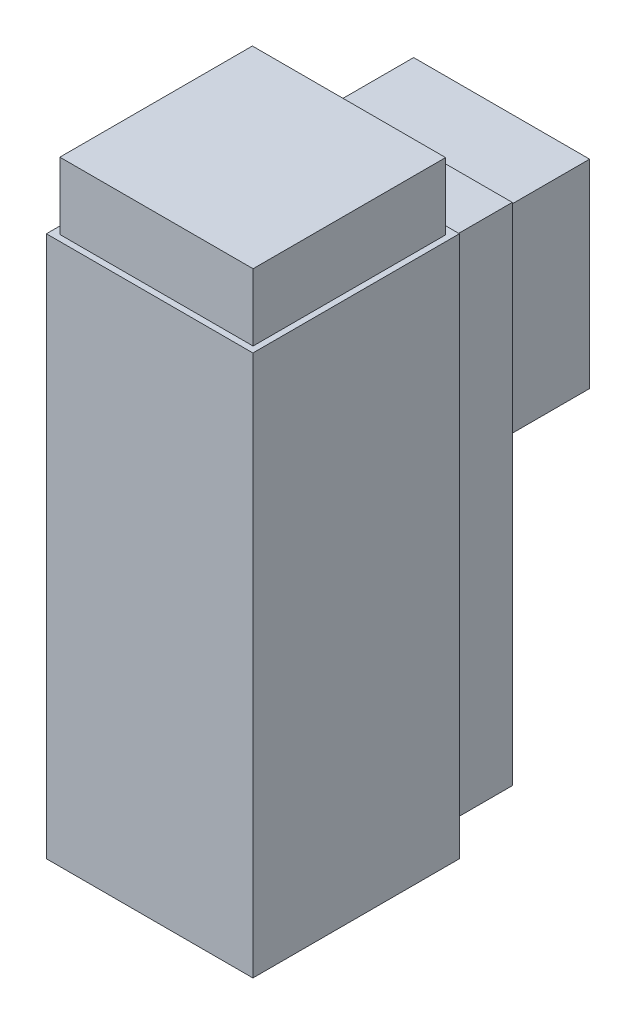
from build123d import *

# Parameters (mm, degrees)
SKETCH1_W           = 33
SKETCH1_H           = 86.5
BOSS_EXTRUDE1_DEPTH = 33
SKETCH2_R           = 7.5
BOSS_EXTRUDE2_DEPTH = 8
SKETCH3_R           = 2.5
CUT_EXTRUDE1_DEPTH  = 8
SKETCH4_W           = 30.224100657
SKETCH4_H           = 80.725129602
BOSS_EXTRUDE5_DEPTH = 10
SKETCH6_W           = 28.119891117
SKETCH6_H           = 31.754434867
BOSS_EXTRUDE6_DEPTH = 13.5
SKETCH7_W           = 30.879958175
SKETCH7_H           = 30.76558796
BOSS_EXTRUDE7_DEPTH = 10.7


with BuildPart() as part:
    # Sketch1 → Boss-Extrude1 (new body)
    with BuildSketch(Plane.XY):
        Rectangle(SKETCH1_W, SKETCH1_H)
    extrude(amount=BOSS_EXTRUDE1_DEPTH)

    # Sketch2 → Boss-Extrude2 (add)
    with BuildSketch(Plane(origin=(0, -43.25, 0), x_dir=(-1, 0, 0), z_dir=(0, -1, 0))):
        with Locations(Location((0, -16.5, 0), (0, 0, 270))):
            Circle(SKETCH2_R)
    extrude(amount=BOSS_EXTRUDE2_DEPTH)

    # Sketch3 → Cut-Extrude1 (cut)
    with BuildSketch(Plane.XZ.offset(51.25)):
        with Locations(Location((0, 16.600200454, 0), (0, 0, 270))):
            Circle(SKETCH3_R)
    extrude(amount=-CUT_EXTRUDE1_DEPTH, mode=Mode.SUBTRACT)

    # Sketch4 → Boss-Extrude5 (add)
    with BuildSketch(Plane(origin=(0, 0, 0), x_dir=(-1, 0, 0), z_dir=(0, 0, -1))):
        with Locations((0.160991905, 1.451815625)):
            Rectangle(SKETCH4_W, SKETCH4_H)
    extrude(amount=BOSS_EXTRUDE5_DEPTH)

    # Sketch6 → Boss-Extrude6 (add)
    with BuildSketch(Plane(origin=(0, 0, -10), x_dir=(-1, 0, 0), z_dir=(0, 0, -1))):
        with Locations((0.256637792, 24.598120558)):
            Rectangle(SKETCH6_W, SKETCH6_H)
    extrude(amount=BOSS_EXTRUDE6_DEPTH)

    # Sketch7 → Boss-Extrude7 (add)
    with BuildSketch(Plane(origin=(0, 43.25, 0), x_dir=(1, 0, 0), z_dir=(0, 1, 0))):
        with Locations((0.114370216, -16.644502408)):
            Rectangle(SKETCH7_W, SKETCH7_H)
    extrude(amount=BOSS_EXTRUDE7_DEPTH)


solid = part.part
